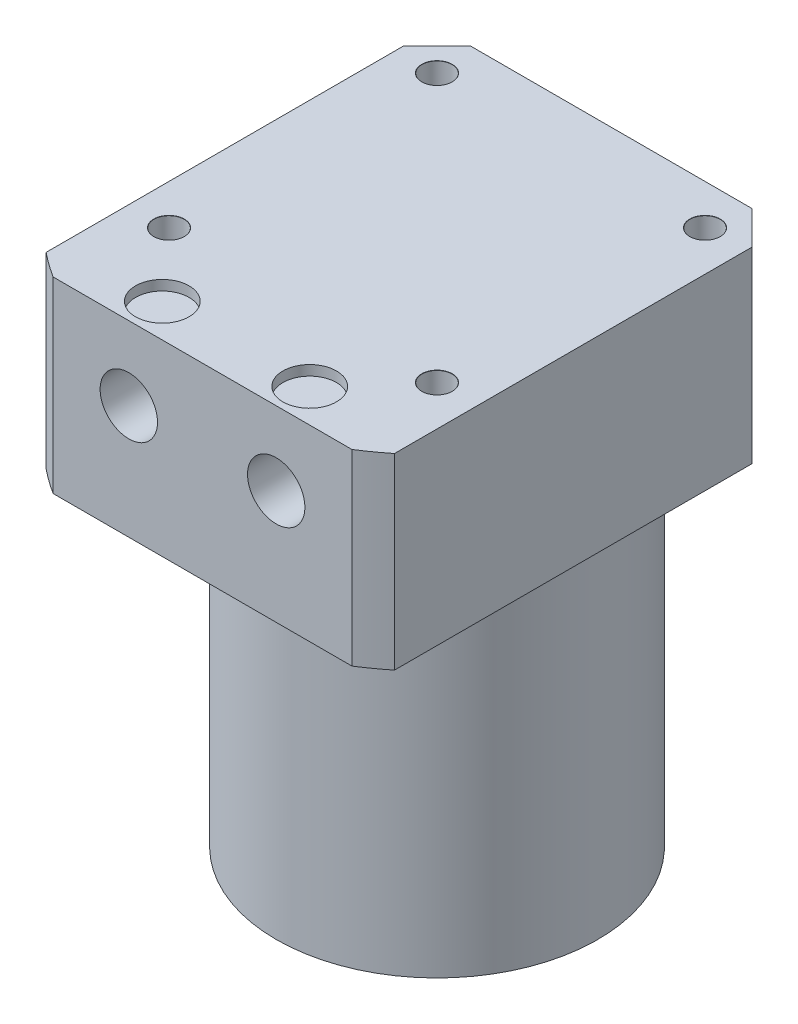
ISO-10303-21;
HEADER;
FILE_DESCRIPTION(('STEP AP214'),'2;1');
FILE_NAME('part.step','',(''),(''),'','','');
FILE_SCHEMA(('AUTOMOTIVE_DESIGN { 1 0 10303 214 1 1 1 1 }'));
ENDSEC;
DATA;
#1=APPLICATION_CONTEXT('core data for automotive mechanical design processes');
#2=APPLICATION_PROTOCOL_DEFINITION('international standard','automotive_design',2000,#1);
#3=PRODUCT_CONTEXT('',#1,'mechanical');
#4=PRODUCT('Part','Part','',(#3));
#5=PRODUCT_RELATED_PRODUCT_CATEGORY('part','',(#4));
#6=PRODUCT_DEFINITION_FORMATION('','',#4);
#7=PRODUCT_DEFINITION_CONTEXT('part definition',#1,'design');
#8=PRODUCT_DEFINITION('design','',#6,#7);
#9=PRODUCT_DEFINITION_SHAPE('','',#8);
#10=(LENGTH_UNIT() NAMED_UNIT(*) SI_UNIT(.MILLI.,.METRE.));
#11=(NAMED_UNIT(*) PLANE_ANGLE_UNIT() SI_UNIT($,.RADIAN.));
#12=(NAMED_UNIT(*) SI_UNIT($,.STERADIAN.) SOLID_ANGLE_UNIT());
#13=UNCERTAINTY_MEASURE_WITH_UNIT(LENGTH_MEASURE(1.E-05),#10,'distance_accuracy_value','');
#14=(GEOMETRIC_REPRESENTATION_CONTEXT(3) GLOBAL_UNCERTAINTY_ASSIGNED_CONTEXT((#13)) GLOBAL_UNIT_ASSIGNED_CONTEXT((#10,
#11,#12)) REPRESENTATION_CONTEXT('',''));
#15=CARTESIAN_POINT('',(0.,0.,0.));
#16=DIRECTION('',(0.,0.,1.));
#17=DIRECTION('',(1.,0.,0.));
#18=AXIS2_PLACEMENT_3D('',#15,#16,#17);
#19=CARTESIAN_POINT('',(-24.,52.,0.));
#20=DIRECTION('',(0.,-1.,0.));
#21=DIRECTION('',(0.,0.,-1.));
#22=AXIS2_PLACEMENT_3D('',#19,#20,#21);
#23=PLANE('',#22);
#24=CARTESIAN_POINT('',(-20.,52.,-20.));
#25=DIRECTION('',(0.,-1.,0.));
#26=DIRECTION('',(0.,0.,-1.));
#27=AXIS2_PLACEMENT_3D('',#24,#25,#26);
#28=CIRCLE('',#27,4.);
#29=CARTESIAN_POINT('',(-20.,52.,-24.));
#30=VERTEX_POINT('',#29);
#31=EDGE_CURVE('E337',#30,#30,#28,.T.);
#32=ORIENTED_EDGE('',*,*,#31,.F.);
#33=EDGE_LOOP('',(#32));
#34=FACE_BOUND('',#33,.T.);
#35=CARTESIAN_POINT('',(20.,52.,-20.));
#36=DIRECTION('',(0.,-1.,0.));
#37=DIRECTION('',(0.,0.,-1.));
#38=AXIS2_PLACEMENT_3D('',#35,#36,#37);
#39=CIRCLE('',#38,4.);
#40=CARTESIAN_POINT('',(20.,52.,-24.));
#41=VERTEX_POINT('',#40);
#42=EDGE_CURVE('E352',#41,#41,#39,.T.);
#43=ORIENTED_EDGE('',*,*,#42,.F.);
#44=EDGE_LOOP('',(#43));
#45=FACE_BOUND('',#44,.T.);
#46=CARTESIAN_POINT('',(20.,52.,20.));
#47=DIRECTION('',(0.,-1.,0.));
#48=DIRECTION('',(0.,0.,-1.));
#49=AXIS2_PLACEMENT_3D('',#46,#47,#48);
#50=CIRCLE('',#49,4.);
#51=CARTESIAN_POINT('',(20.,52.,16.));
#52=VERTEX_POINT('',#51);
#53=EDGE_CURVE('E367',#52,#52,#50,.T.);
#54=ORIENTED_EDGE('',*,*,#53,.F.);
#55=EDGE_LOOP('',(#54));
#56=FACE_BOUND('',#55,.T.);
#57=CARTESIAN_POINT('',(-20.,52.,20.));
#58=DIRECTION('',(0.,-1.,0.));
#59=DIRECTION('',(0.,0.,-1.));
#60=AXIS2_PLACEMENT_3D('',#57,#58,#59);
#61=CIRCLE('',#60,4.);
#62=CARTESIAN_POINT('',(-20.,52.,16.));
#63=VERTEX_POINT('',#62);
#64=EDGE_CURVE('E382',#63,#63,#61,.T.);
#65=ORIENTED_EDGE('',*,*,#64,.F.);
#66=EDGE_LOOP('',(#65));
#67=FACE_BOUND('',#66,.T.);
#68=CARTESIAN_POINT('',(0.,52.,0.));
#69=DIRECTION('',(0.,1.,0.));
#70=DIRECTION('',(0.,0.,1.));
#71=AXIS2_PLACEMENT_3D('',#68,#69,#70);
#72=CIRCLE('',#71,24.);
#73=CARTESIAN_POINT('',(0.,52.,24.));
#74=VERTEX_POINT('',#73);
#75=EDGE_CURVE('E134',#74,#74,#72,.T.);
#76=ORIENTED_EDGE('',*,*,#75,.T.);
#77=EDGE_LOOP('',(#76));
#78=FACE_BOUND('',#77,.T.);
#79=DIRECTION('',(1.,0.,0.));
#80=VECTOR('',#79,1.);
#81=CARTESIAN_POINT('',(-24.,52.,-26.));
#82=LINE('',#81,#80);
#83=CARTESIAN_POINT('',(-21.,52.,-26.));
#84=VERTEX_POINT('',#83);
#85=CARTESIAN_POINT('',(21.,52.,-26.));
#86=VERTEX_POINT('',#85);
#87=EDGE_CURVE('E108',#84,#86,#82,.T.);
#88=ORIENTED_EDGE('',*,*,#87,.T.);
#89=DIRECTION('',(-0.707106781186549,0.,-0.707106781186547));
#90=VECTOR('',#89,1.);
#91=CARTESIAN_POINT('',(11.4999999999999,52.,-35.5));
#92=LINE('',#91,#90);
#93=CARTESIAN_POINT('',(26.,52.,-21.));
#94=VERTEX_POINT('',#93);
#95=EDGE_CURVE('E42',#86,#94,#92,.F.);
#96=ORIENTED_EDGE('',*,*,#95,.T.);
#97=DIRECTION('',(0.,0.,1.));
#98=VECTOR('',#97,1.);
#99=CARTESIAN_POINT('',(26.,52.,0.));
#100=LINE('',#99,#98);
#101=CARTESIAN_POINT('',(26.,52.,32.3457879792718));
#102=VERTEX_POINT('',#101);
#103=EDGE_CURVE('E123',#94,#102,#100,.T.);
#104=ORIENTED_EDGE('',*,*,#103,.T.);
#105=CARTESIAN_POINT('',(0.,52.,0.));
#106=DIRECTION('',(0.,1.,0.));
#107=DIRECTION('',(0.,0.,1.));
#108=AXIS2_PLACEMENT_3D('',#105,#106,#107);
#109=CIRCLE('',#108,41.5);
#110=CARTESIAN_POINT('',(22.2991031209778,52.,35.));
#111=VERTEX_POINT('',#110);
#112=EDGE_CURVE('E131',#111,#102,#109,.T.);
#113=ORIENTED_EDGE('',*,*,#112,.F.);
#114=DIRECTION('',(-1.,0.,0.));
#115=VECTOR('',#114,1.);
#116=CARTESIAN_POINT('',(-24.,52.,35.));
#117=LINE('',#116,#115);
#118=CARTESIAN_POINT('',(-22.2991031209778,52.,35.));
#119=VERTEX_POINT('',#118);
#120=EDGE_CURVE('E178',#111,#119,#117,.T.);
#121=ORIENTED_EDGE('',*,*,#120,.T.);
#122=CARTESIAN_POINT('',(-26.,52.,32.3457879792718));
#123=VERTEX_POINT('',#122);
#124=EDGE_CURVE('E126',#123,#119,#109,.T.);
#125=ORIENTED_EDGE('',*,*,#124,.F.);
#126=DIRECTION('',(0.,0.,-1.));
#127=VECTOR('',#126,1.);
#128=CARTESIAN_POINT('',(-26.,52.,0.));
#129=LINE('',#128,#127);
#130=CARTESIAN_POINT('',(-26.,52.,-21.));
#131=VERTEX_POINT('',#130);
#132=EDGE_CURVE('E114',#123,#131,#129,.T.);
#133=ORIENTED_EDGE('',*,*,#132,.T.);
#134=DIRECTION('',(-0.707106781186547,0.,0.707106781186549));
#135=VECTOR('',#134,1.);
#136=CARTESIAN_POINT('',(-35.5,52.,-11.5));
#137=LINE('',#136,#135);
#138=EDGE_CURVE('E154',#131,#84,#137,.F.);
#139=ORIENTED_EDGE('',*,*,#138,.T.);
#140=EDGE_LOOP('',(#88,#96,#104,#113,#121,#125,#133,#139));
#141=FACE_BOUND('',#140,.T.);
#142=ADVANCED_FACE('F34',(#34,#45,#56,#67,#78,#141),#23,.T.);
#143=CARTESIAN_POINT('',(0.,87.0508296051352,0.));
#144=DIRECTION('',(0.,1.,0.));
#145=DIRECTION('',(0.,0.,1.));
#146=AXIS2_PLACEMENT_3D('',#143,#144,#145);
#147=CYLINDRICAL_SURFACE('',#146,41.5);
#148=ORIENTED_EDGE('',*,*,#112,.T.);
#149=DIRECTION('',(0.,1.,0.));
#150=VECTOR('',#149,1.);
#151=CARTESIAN_POINT('',(26.,87.0508296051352,32.3457879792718));
#152=LINE('',#151,#150);
#153=CARTESIAN_POINT('',(26.,80.,32.3457879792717));
#154=VERTEX_POINT('',#153);
#155=EDGE_CURVE('E127',#102,#154,#152,.T.);
#156=ORIENTED_EDGE('',*,*,#155,.T.);
#157=CARTESIAN_POINT('',(0.,80.,0.));
#158=DIRECTION('',(0.,1.,0.));
#159=DIRECTION('',(0.,0.,1.));
#160=AXIS2_PLACEMENT_3D('',#157,#158,#159);
#161=CIRCLE('',#160,41.5);
#162=CARTESIAN_POINT('',(22.2991031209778,80.,35.));
#163=VERTEX_POINT('',#162);
#164=EDGE_CURVE('E122',#163,#154,#161,.T.);
#165=ORIENTED_EDGE('',*,*,#164,.F.);
#166=DIRECTION('',(0.,1.,0.));
#167=VECTOR('',#166,1.);
#168=CARTESIAN_POINT('',(22.2991031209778,87.0508296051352,35.));
#169=LINE('',#168,#167);
#170=EDGE_CURVE('E181',#163,#111,#169,.F.);
#171=ORIENTED_EDGE('',*,*,#170,.T.);
#172=EDGE_LOOP('',(#148,#156,#165,#171));
#173=FACE_BOUND('',#172,.T.);
#174=ADVANCED_FACE('F185',(#173),#147,.T.);
#175=ORIENTED_EDGE('',*,*,#124,.T.);
#176=DIRECTION('',(0.,1.,0.));
#177=VECTOR('',#176,1.);
#178=CARTESIAN_POINT('',(-22.2991031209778,87.0508296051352,35.));
#179=LINE('',#178,#177);
#180=CARTESIAN_POINT('',(-22.2991031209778,80.,35.));
#181=VERTEX_POINT('',#180);
#182=EDGE_CURVE('E121',#119,#181,#179,.T.);
#183=ORIENTED_EDGE('',*,*,#182,.T.);
#184=CARTESIAN_POINT('',(-26.,80.,32.3457879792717));
#185=VERTEX_POINT('',#184);
#186=EDGE_CURVE('E105',#185,#181,#161,.T.);
#187=ORIENTED_EDGE('',*,*,#186,.F.);
#188=DIRECTION('',(0.,1.,0.));
#189=VECTOR('',#188,1.);
#190=CARTESIAN_POINT('',(-26.,87.0508296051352,32.3457879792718));
#191=LINE('',#190,#189);
#192=EDGE_CURVE('E112',#185,#123,#191,.F.);
#193=ORIENTED_EDGE('',*,*,#192,.T.);
#194=EDGE_LOOP('',(#175,#183,#187,#193));
#195=FACE_BOUND('',#194,.T.);
#196=ADVANCED_FACE('F120',(#195),#147,.T.);
#197=CARTESIAN_POINT('',(-41.5,80.,0.));
#198=DIRECTION('',(0.,1.,0.));
#199=DIRECTION('',(0.,0.,1.));
#200=AXIS2_PLACEMENT_3D('',#197,#198,#199);
#201=PLANE('',#200);
#202=CARTESIAN_POINT('',(-20.,80.,-20.));
#203=DIRECTION('',(0.,-1.,0.));
#204=DIRECTION('',(0.,0.,-1.));
#205=AXIS2_PLACEMENT_3D('',#202,#203,#204);
#206=CIRCLE('',#205,2.27499999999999);
#207=CARTESIAN_POINT('',(-20.,80.,-22.275));
#208=VERTEX_POINT('',#207);
#209=EDGE_CURVE('E338',#208,#208,#206,.T.);
#210=ORIENTED_EDGE('',*,*,#209,.T.);
#211=EDGE_LOOP('',(#210));
#212=FACE_BOUND('',#211,.T.);
#213=CARTESIAN_POINT('',(20.,80.,-20.));
#214=DIRECTION('',(0.,-1.,0.));
#215=DIRECTION('',(0.,0.,-1.));
#216=AXIS2_PLACEMENT_3D('',#213,#214,#215);
#217=CIRCLE('',#216,2.27499999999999);
#218=CARTESIAN_POINT('',(20.,80.,-22.275));
#219=VERTEX_POINT('',#218);
#220=EDGE_CURVE('E349',#219,#219,#217,.T.);
#221=ORIENTED_EDGE('',*,*,#220,.T.);
#222=EDGE_LOOP('',(#221));
#223=FACE_BOUND('',#222,.T.);
#224=CARTESIAN_POINT('',(20.,80.,20.));
#225=DIRECTION('',(0.,-1.,0.));
#226=DIRECTION('',(0.,0.,-1.));
#227=AXIS2_PLACEMENT_3D('',#224,#225,#226);
#228=CIRCLE('',#227,2.27499999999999);
#229=CARTESIAN_POINT('',(20.,80.,17.725));
#230=VERTEX_POINT('',#229);
#231=EDGE_CURVE('E364',#230,#230,#228,.T.);
#232=ORIENTED_EDGE('',*,*,#231,.T.);
#233=EDGE_LOOP('',(#232));
#234=FACE_BOUND('',#233,.T.);
#235=CARTESIAN_POINT('',(-20.,80.,20.));
#236=DIRECTION('',(0.,-1.,0.));
#237=DIRECTION('',(0.,0.,-1.));
#238=AXIS2_PLACEMENT_3D('',#235,#236,#237);
#239=CIRCLE('',#238,2.27499999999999);
#240=CARTESIAN_POINT('',(-20.,80.,17.725));
#241=VERTEX_POINT('',#240);
#242=EDGE_CURVE('E379',#241,#241,#239,.T.);
#243=ORIENTED_EDGE('',*,*,#242,.T.);
#244=EDGE_LOOP('',(#243));
#245=FACE_BOUND('',#244,.T.);
#246=CARTESIAN_POINT('',(-11.,80.,30.));
#247=DIRECTION('',(0.,1.,0.));
#248=DIRECTION('',(0.,0.,1.));
#249=AXIS2_PLACEMENT_3D('',#246,#247,#248);
#250=CIRCLE('',#249,4.);
#251=CARTESIAN_POINT('',(-11.,80.,34.));
#252=VERTEX_POINT('',#251);
#253=EDGE_CURVE('E406',#252,#252,#250,.T.);
#254=ORIENTED_EDGE('',*,*,#253,.F.);
#255=EDGE_LOOP('',(#254));
#256=FACE_BOUND('',#255,.T.);
#257=CARTESIAN_POINT('',(11.,80.,30.));
#258=DIRECTION('',(0.,1.,0.));
#259=DIRECTION('',(0.,0.,1.));
#260=AXIS2_PLACEMENT_3D('',#257,#258,#259);
#261=CIRCLE('',#260,4.);
#262=CARTESIAN_POINT('',(11.,80.,34.));
#263=VERTEX_POINT('',#262);
#264=EDGE_CURVE('E171',#263,#263,#261,.T.);
#265=ORIENTED_EDGE('',*,*,#264,.F.);
#266=EDGE_LOOP('',(#265));
#267=FACE_BOUND('',#266,.T.);
#268=DIRECTION('',(0.,0.,-1.));
#269=VECTOR('',#268,1.);
#270=CARTESIAN_POINT('',(26.,80.,0.));
#271=LINE('',#270,#269);
#272=CARTESIAN_POINT('',(26.,80.,-21.));
#273=VERTEX_POINT('',#272);
#274=EDGE_CURVE('E140',#154,#273,#271,.T.);
#275=ORIENTED_EDGE('',*,*,#274,.T.);
#276=DIRECTION('',(0.707106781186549,0.,0.707106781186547));
#277=VECTOR('',#276,1.);
#278=CARTESIAN_POINT('',(2.74999999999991,80.,-44.25));
#279=LINE('',#278,#277);
#280=CARTESIAN_POINT('',(21.,80.,-26.));
#281=VERTEX_POINT('',#280);
#282=EDGE_CURVE('E148',#273,#281,#279,.F.);
#283=ORIENTED_EDGE('',*,*,#282,.T.);
#284=DIRECTION('',(-1.,0.,0.));
#285=VECTOR('',#284,1.);
#286=CARTESIAN_POINT('',(-26.,80.,-26.));
#287=LINE('',#286,#285);
#288=CARTESIAN_POINT('',(-21.,80.,-26.));
#289=VERTEX_POINT('',#288);
#290=EDGE_CURVE('E109',#281,#289,#287,.T.);
#291=ORIENTED_EDGE('',*,*,#290,.T.);
#292=DIRECTION('',(0.707106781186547,0.,-0.707106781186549));
#293=VECTOR('',#292,1.);
#294=CARTESIAN_POINT('',(-44.25,80.,-2.74999999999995));
#295=LINE('',#294,#293);
#296=CARTESIAN_POINT('',(-26.,80.,-21.));
#297=VERTEX_POINT('',#296);
#298=EDGE_CURVE('E107',#289,#297,#295,.F.);
#299=ORIENTED_EDGE('',*,*,#298,.T.);
#300=DIRECTION('',(0.,0.,1.));
#301=VECTOR('',#300,1.);
#302=CARTESIAN_POINT('',(-26.,80.,-26.));
#303=LINE('',#302,#301);
#304=EDGE_CURVE('E99',#297,#185,#303,.T.);
#305=ORIENTED_EDGE('',*,*,#304,.T.);
#306=ORIENTED_EDGE('',*,*,#186,.T.);
#307=DIRECTION('',(1.,0.,0.));
#308=VECTOR('',#307,1.);
#309=CARTESIAN_POINT('',(-41.5,80.,35.));
#310=LINE('',#309,#308);
#311=EDGE_CURVE('E142',#181,#163,#310,.T.);
#312=ORIENTED_EDGE('',*,*,#311,.T.);
#313=ORIENTED_EDGE('',*,*,#164,.T.);
#314=EDGE_LOOP('',(#275,#283,#291,#299,#305,#306,#312,#313));
#315=FACE_BOUND('',#314,.T.);
#316=ADVANCED_FACE('F102',(#212,#223,#234,#245,#256,#267,#315),#201,.T.);
#317=CARTESIAN_POINT('',(0.,0.,0.));
#318=DIRECTION('',(0.,-1.,0.));
#319=DIRECTION('',(0.,0.,-1.));
#320=AXIS2_PLACEMENT_3D('',#317,#318,#319);
#321=PLANE('',#320);
#322=CARTESIAN_POINT('',(0.,0.,0.));
#323=DIRECTION('',(0.,1.,0.));
#324=DIRECTION('',(0.,0.,1.));
#325=AXIS2_PLACEMENT_3D('',#322,#323,#324);
#326=CIRCLE('',#325,24.);
#327=CARTESIAN_POINT('',(0.,0.,24.));
#328=VERTEX_POINT('',#327);
#329=EDGE_CURVE('E137',#328,#328,#326,.T.);
#330=ORIENTED_EDGE('',*,*,#329,.F.);
#331=EDGE_LOOP('',(#330));
#332=FACE_BOUND('',#331,.T.);
#333=ADVANCED_FACE('F213',(#332),#321,.T.);
#334=CARTESIAN_POINT('',(0.,87.0508296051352,0.));
#335=DIRECTION('',(0.,1.,0.));
#336=DIRECTION('',(0.,0.,1.));
#337=AXIS2_PLACEMENT_3D('',#334,#335,#336);
#338=CYLINDRICAL_SURFACE('',#337,24.);
#339=ORIENTED_EDGE('',*,*,#329,.T.);
#340=EDGE_LOOP('',(#339));
#341=FACE_BOUND('',#340,.T.);
#342=ORIENTED_EDGE('',*,*,#75,.F.);
#343=EDGE_LOOP('',(#342));
#344=FACE_BOUND('',#343,.T.);
#345=ADVANCED_FACE('F210',(#341,#344),#338,.T.);
#346=CARTESIAN_POINT('',(-26.,0.,-26.));
#347=DIRECTION('',(0.,0.,-1.));
#348=DIRECTION('',(-1.,0.,0.));
#349=AXIS2_PLACEMENT_3D('',#346,#347,#348);
#350=PLANE('',#349);
#351=ORIENTED_EDGE('',*,*,#290,.F.);
#352=DIRECTION('',(0.,-1.,0.));
#353=VECTOR('',#352,1.);
#354=CARTESIAN_POINT('',(21.,0.,-26.));
#355=LINE('',#354,#353);
#356=EDGE_CURVE('E55',#281,#86,#355,.T.);
#357=ORIENTED_EDGE('',*,*,#356,.T.);
#358=ORIENTED_EDGE('',*,*,#87,.F.);
#359=DIRECTION('',(0.,1.,0.));
#360=VECTOR('',#359,1.);
#361=CARTESIAN_POINT('',(-21.,0.,-26.));
#362=LINE('',#361,#360);
#363=EDGE_CURVE('E150',#84,#289,#362,.T.);
#364=ORIENTED_EDGE('',*,*,#363,.T.);
#365=EDGE_LOOP('',(#351,#357,#358,#364));
#366=FACE_BOUND('',#365,.T.);
#367=ADVANCED_FACE('F166',(#366),#350,.T.);
#368=CARTESIAN_POINT('',(-26.,0.,-26.));
#369=DIRECTION('',(-1.,0.,0.));
#370=DIRECTION('',(0.,0.,1.));
#371=AXIS2_PLACEMENT_3D('',#368,#369,#370);
#372=PLANE('',#371);
#373=ORIENTED_EDGE('',*,*,#304,.F.);
#374=DIRECTION('',(0.,-1.,0.));
#375=VECTOR('',#374,1.);
#376=CARTESIAN_POINT('',(-26.,0.,-21.));
#377=LINE('',#376,#375);
#378=EDGE_CURVE('E12',#297,#131,#377,.T.);
#379=ORIENTED_EDGE('',*,*,#378,.T.);
#380=ORIENTED_EDGE('',*,*,#132,.F.);
#381=ORIENTED_EDGE('',*,*,#192,.F.);
#382=EDGE_LOOP('',(#373,#379,#380,#381));
#383=FACE_BOUND('',#382,.T.);
#384=ADVANCED_FACE('F113',(#383),#372,.T.);
#385=CARTESIAN_POINT('',(26.,0.,-26.));
#386=DIRECTION('',(1.,0.,0.));
#387=DIRECTION('',(0.,0.,-1.));
#388=AXIS2_PLACEMENT_3D('',#385,#386,#387);
#389=PLANE('',#388);
#390=ORIENTED_EDGE('',*,*,#103,.F.);
#391=DIRECTION('',(0.,1.,0.));
#392=VECTOR('',#391,1.);
#393=CARTESIAN_POINT('',(26.,0.,-21.));
#394=LINE('',#393,#392);
#395=EDGE_CURVE('E144',#94,#273,#394,.T.);
#396=ORIENTED_EDGE('',*,*,#395,.T.);
#397=ORIENTED_EDGE('',*,*,#274,.F.);
#398=ORIENTED_EDGE('',*,*,#155,.F.);
#399=EDGE_LOOP('',(#390,#396,#397,#398));
#400=FACE_BOUND('',#399,.T.);
#401=ADVANCED_FACE('F163',(#400),#389,.T.);
#402=CARTESIAN_POINT('',(-26.,0.,35.));
#403=DIRECTION('',(0.,0.,1.));
#404=DIRECTION('',(1.,0.,0.));
#405=AXIS2_PLACEMENT_3D('',#402,#403,#404);
#406=PLANE('',#405);
#407=CARTESIAN_POINT('',(-11.,69.,35.));
#408=DIRECTION('',(0.,0.,1.));
#409=DIRECTION('',(1.,0.,0.));
#410=AXIS2_PLACEMENT_3D('',#407,#408,#409);
#411=CIRCLE('',#410,4.283);
#412=CARTESIAN_POINT('',(-6.717,69.,35.));
#413=VERTEX_POINT('',#412);
#414=EDGE_CURVE('E394',#413,#413,#411,.T.);
#415=ORIENTED_EDGE('',*,*,#414,.F.);
#416=EDGE_LOOP('',(#415));
#417=FACE_BOUND('',#416,.T.);
#418=CARTESIAN_POINT('',(11.,69.,35.));
#419=DIRECTION('',(0.,0.,1.));
#420=DIRECTION('',(1.,0.,0.));
#421=AXIS2_PLACEMENT_3D('',#418,#419,#420);
#422=CIRCLE('',#421,4.283);
#423=CARTESIAN_POINT('',(15.283,69.,35.));
#424=VERTEX_POINT('',#423);
#425=EDGE_CURVE('E400',#424,#424,#422,.T.);
#426=ORIENTED_EDGE('',*,*,#425,.F.);
#427=EDGE_LOOP('',(#426));
#428=FACE_BOUND('',#427,.T.);
#429=ORIENTED_EDGE('',*,*,#311,.F.);
#430=ORIENTED_EDGE('',*,*,#182,.F.);
#431=ORIENTED_EDGE('',*,*,#120,.F.);
#432=ORIENTED_EDGE('',*,*,#170,.F.);
#433=EDGE_LOOP('',(#429,#430,#431,#432));
#434=FACE_BOUND('',#433,.T.);
#435=ADVANCED_FACE('F187',(#417,#428,#434),#406,.T.);
#436=CARTESIAN_POINT('',(26.,0.,-21.));
#437=DIRECTION('',(-0.707106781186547,0.,0.707106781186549));
#438=DIRECTION('',(0.707106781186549,0.,0.707106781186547));
#439=AXIS2_PLACEMENT_3D('',#436,#437,#438);
#440=PLANE('',#439);
#441=ORIENTED_EDGE('',*,*,#95,.F.);
#442=ORIENTED_EDGE('',*,*,#356,.F.);
#443=ORIENTED_EDGE('',*,*,#282,.F.);
#444=ORIENTED_EDGE('',*,*,#395,.F.);
#445=EDGE_LOOP('',(#441,#442,#443,#444));
#446=FACE_BOUND('',#445,.T.);
#447=ADVANCED_FACE('F165',(#446),#440,.F.);
#448=CARTESIAN_POINT('',(-21.,0.,-26.));
#449=DIRECTION('',(0.707106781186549,0.,0.707106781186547));
#450=DIRECTION('',(0.707106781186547,0.,-0.707106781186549));
#451=AXIS2_PLACEMENT_3D('',#448,#449,#450);
#452=PLANE('',#451);
#453=ORIENTED_EDGE('',*,*,#138,.F.);
#454=ORIENTED_EDGE('',*,*,#378,.F.);
#455=ORIENTED_EDGE('',*,*,#298,.F.);
#456=ORIENTED_EDGE('',*,*,#363,.F.);
#457=EDGE_LOOP('',(#453,#454,#455,#456));
#458=FACE_BOUND('',#457,.T.);
#459=ADVANCED_FACE('F36',(#458),#452,.F.);
#460=CARTESIAN_POINT('',(11.,78.5,30.));
#461=DIRECTION('',(0.,-1.,0.));
#462=DIRECTION('',(0.,0.,-1.));
#463=AXIS2_PLACEMENT_3D('',#460,#461,#462);
#464=PLANE('',#463);
#465=CARTESIAN_POINT('',(11.,78.5,30.));
#466=DIRECTION('',(0.,1.,0.));
#467=DIRECTION('',(0.,0.,1.));
#468=AXIS2_PLACEMENT_3D('',#465,#466,#467);
#469=CIRCLE('',#468,4.);
#470=CARTESIAN_POINT('',(11.,78.5,34.));
#471=VERTEX_POINT('',#470);
#472=EDGE_CURVE('E168',#471,#471,#469,.T.);
#473=ORIENTED_EDGE('',*,*,#472,.T.);
#474=EDGE_LOOP('',(#473));
#475=FACE_BOUND('',#474,.T.);
#476=ADVANCED_FACE('F191',(#475),#464,.F.);
#477=CARTESIAN_POINT('',(11.,80.,30.));
#478=DIRECTION('',(0.,1.,0.));
#479=DIRECTION('',(0.,0.,1.));
#480=AXIS2_PLACEMENT_3D('',#477,#478,#479);
#481=CYLINDRICAL_SURFACE('',#480,4.);
#482=ORIENTED_EDGE('',*,*,#472,.F.);
#483=EDGE_LOOP('',(#482));
#484=FACE_BOUND('',#483,.T.);
#485=ORIENTED_EDGE('',*,*,#264,.T.);
#486=EDGE_LOOP('',(#485));
#487=FACE_BOUND('',#486,.T.);
#488=ADVANCED_FACE('F196',(#484,#487),#481,.F.);
#489=CARTESIAN_POINT('',(-11.,78.5,30.));
#490=DIRECTION('',(0.,-1.,0.));
#491=DIRECTION('',(0.,0.,-1.));
#492=AXIS2_PLACEMENT_3D('',#489,#490,#491);
#493=PLANE('',#492);
#494=CARTESIAN_POINT('',(-11.,78.5,30.));
#495=DIRECTION('',(0.,1.,0.));
#496=DIRECTION('',(0.,0.,1.));
#497=AXIS2_PLACEMENT_3D('',#494,#495,#496);
#498=CIRCLE('',#497,4.);
#499=CARTESIAN_POINT('',(-11.,78.5,34.));
#500=VERTEX_POINT('',#499);
#501=EDGE_CURVE('E409',#500,#500,#498,.T.);
#502=ORIENTED_EDGE('',*,*,#501,.T.);
#503=EDGE_LOOP('',(#502));
#504=FACE_BOUND('',#503,.T.);
#505=ADVANCED_FACE('F242',(#504),#493,.F.);
#506=CARTESIAN_POINT('',(-11.,80.,30.));
#507=DIRECTION('',(0.,1.,0.));
#508=DIRECTION('',(0.,0.,1.));
#509=AXIS2_PLACEMENT_3D('',#506,#507,#508);
#510=CYLINDRICAL_SURFACE('',#509,4.);
#511=ORIENTED_EDGE('',*,*,#501,.F.);
#512=EDGE_LOOP('',(#511));
#513=FACE_BOUND('',#512,.T.);
#514=ORIENTED_EDGE('',*,*,#253,.T.);
#515=EDGE_LOOP('',(#514));
#516=FACE_BOUND('',#515,.T.);
#517=ADVANCED_FACE('F246',(#513,#516),#510,.F.);
#518=CARTESIAN_POINT('',(11.,69.,12.82));
#519=DIRECTION('',(0.,0.,-1.));
#520=DIRECTION('',(-1.,0.,0.));
#521=AXIS2_PLACEMENT_3D('',#518,#519,#520);
#522=PLANE('',#521);
#523=CARTESIAN_POINT('',(11.,69.,12.82));
#524=DIRECTION('',(0.,0.,1.));
#525=DIRECTION('',(1.,0.,0.));
#526=AXIS2_PLACEMENT_3D('',#523,#524,#525);
#527=CIRCLE('',#526,4.283);
#528=CARTESIAN_POINT('',(15.283,69.,12.82));
#529=VERTEX_POINT('',#528);
#530=EDGE_CURVE('E403',#529,#529,#527,.T.);
#531=ORIENTED_EDGE('',*,*,#530,.T.);
#532=EDGE_LOOP('',(#531));
#533=FACE_BOUND('',#532,.T.);
#534=ADVANCED_FACE('F250',(#533),#522,.F.);
#535=CARTESIAN_POINT('',(11.,69.,35.));
#536=DIRECTION('',(0.,0.,1.));
#537=DIRECTION('',(1.,0.,0.));
#538=AXIS2_PLACEMENT_3D('',#535,#536,#537);
#539=CYLINDRICAL_SURFACE('',#538,4.283);
#540=ORIENTED_EDGE('',*,*,#530,.F.);
#541=EDGE_LOOP('',(#540));
#542=FACE_BOUND('',#541,.T.);
#543=ORIENTED_EDGE('',*,*,#425,.T.);
#544=EDGE_LOOP('',(#543));
#545=FACE_BOUND('',#544,.T.);
#546=ADVANCED_FACE('F254',(#542,#545),#539,.F.);
#547=CARTESIAN_POINT('',(-11.,69.,12.82));
#548=DIRECTION('',(0.,0.,-1.));
#549=DIRECTION('',(-1.,0.,0.));
#550=AXIS2_PLACEMENT_3D('',#547,#548,#549);
#551=PLANE('',#550);
#552=CARTESIAN_POINT('',(-11.,69.,12.82));
#553=DIRECTION('',(0.,0.,1.));
#554=DIRECTION('',(1.,0.,0.));
#555=AXIS2_PLACEMENT_3D('',#552,#553,#554);
#556=CIRCLE('',#555,4.283);
#557=CARTESIAN_POINT('',(-6.717,69.,12.82));
#558=VERTEX_POINT('',#557);
#559=EDGE_CURVE('E397',#558,#558,#556,.T.);
#560=ORIENTED_EDGE('',*,*,#559,.T.);
#561=EDGE_LOOP('',(#560));
#562=FACE_BOUND('',#561,.T.);
#563=ADVANCED_FACE('F258',(#562),#551,.F.);
#564=CARTESIAN_POINT('',(-11.,69.,35.));
#565=DIRECTION('',(0.,0.,1.));
#566=DIRECTION('',(1.,0.,0.));
#567=AXIS2_PLACEMENT_3D('',#564,#565,#566);
#568=CYLINDRICAL_SURFACE('',#567,4.283);
#569=ORIENTED_EDGE('',*,*,#559,.F.);
#570=EDGE_LOOP('',(#569));
#571=FACE_BOUND('',#570,.T.);
#572=ORIENTED_EDGE('',*,*,#414,.T.);
#573=EDGE_LOOP('',(#572));
#574=FACE_BOUND('',#573,.T.);
#575=ADVANCED_FACE('F262',(#571,#574),#568,.F.);
#576=CARTESIAN_POINT('',(-20.,79.975,20.));
#577=DIRECTION('',(0.,1.,0.));
#578=DIRECTION('',(0.,0.,1.));
#579=AXIS2_PLACEMENT_3D('',#576,#577,#578);
#580=CONICAL_SURFACE('',#579,2.25,0.785398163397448);
#581=ORIENTED_EDGE('',*,*,#242,.F.);
#582=EDGE_LOOP('',(#581));
#583=FACE_BOUND('',#582,.T.);
#584=CARTESIAN_POINT('',(-20.,79.975,20.));
#585=DIRECTION('',(0.,-1.,0.));
#586=DIRECTION('',(0.,0.,-1.));
#587=AXIS2_PLACEMENT_3D('',#584,#585,#586);
#588=CIRCLE('',#587,2.25);
#589=CARTESIAN_POINT('',(-20.,79.975,17.75));
#590=VERTEX_POINT('',#589);
#591=EDGE_CURVE('E391',#590,#590,#588,.T.);
#592=ORIENTED_EDGE('',*,*,#591,.T.);
#593=EDGE_LOOP('',(#592));
#594=FACE_BOUND('',#593,.T.);
#595=ADVANCED_FACE('F266',(#583,#594),#580,.F.);
#596=CARTESIAN_POINT('',(-20.,52.,20.));
#597=DIRECTION('',(0.,-1.,0.));
#598=DIRECTION('',(0.,0.,-1.));
#599=AXIS2_PLACEMENT_3D('',#596,#597,#598);
#600=CYLINDRICAL_SURFACE('',#599,2.25);
#601=ORIENTED_EDGE('',*,*,#591,.F.);
#602=EDGE_LOOP('',(#601));
#603=FACE_BOUND('',#602,.T.);
#604=CARTESIAN_POINT('',(-20.,56.,20.));
#605=DIRECTION('',(0.,-1.,0.));
#606=DIRECTION('',(0.,0.,-1.));
#607=AXIS2_PLACEMENT_3D('',#604,#605,#606);
#608=CIRCLE('',#607,2.25);
#609=CARTESIAN_POINT('',(-20.,56.,17.75));
#610=VERTEX_POINT('',#609);
#611=EDGE_CURVE('E388',#610,#610,#608,.T.);
#612=ORIENTED_EDGE('',*,*,#611,.T.);
#613=EDGE_LOOP('',(#612));
#614=FACE_BOUND('',#613,.T.);
#615=ADVANCED_FACE('F270',(#603,#614),#600,.F.);
#616=CARTESIAN_POINT('',(-17.75,56.,20.));
#617=DIRECTION('',(0.,1.,0.));
#618=DIRECTION('',(0.,0.,1.));
#619=AXIS2_PLACEMENT_3D('',#616,#617,#618);
#620=PLANE('',#619);
#621=ORIENTED_EDGE('',*,*,#611,.F.);
#622=EDGE_LOOP('',(#621));
#623=FACE_BOUND('',#622,.T.);
#624=CARTESIAN_POINT('',(-20.,56.,20.));
#625=DIRECTION('',(0.,-1.,0.));
#626=DIRECTION('',(0.,0.,-1.));
#627=AXIS2_PLACEMENT_3D('',#624,#625,#626);
#628=CIRCLE('',#627,4.);
#629=CARTESIAN_POINT('',(-20.,56.,16.));
#630=VERTEX_POINT('',#629);
#631=EDGE_CURVE('E385',#630,#630,#628,.T.);
#632=ORIENTED_EDGE('',*,*,#631,.T.);
#633=EDGE_LOOP('',(#632));
#634=FACE_BOUND('',#633,.T.);
#635=ADVANCED_FACE('F274',(#623,#634),#620,.F.);
#636=CARTESIAN_POINT('',(-20.,52.,20.));
#637=DIRECTION('',(0.,-1.,0.));
#638=DIRECTION('',(0.,0.,-1.));
#639=AXIS2_PLACEMENT_3D('',#636,#637,#638);
#640=CYLINDRICAL_SURFACE('',#639,4.);
#641=ORIENTED_EDGE('',*,*,#631,.F.);
#642=EDGE_LOOP('',(#641));
#643=FACE_BOUND('',#642,.T.);
#644=ORIENTED_EDGE('',*,*,#64,.T.);
#645=EDGE_LOOP('',(#644));
#646=FACE_BOUND('',#645,.T.);
#647=ADVANCED_FACE('F278',(#643,#646),#640,.F.);
#648=CARTESIAN_POINT('',(20.,79.975,20.));
#649=DIRECTION('',(0.,1.,0.));
#650=DIRECTION('',(0.,0.,1.));
#651=AXIS2_PLACEMENT_3D('',#648,#649,#650);
#652=CONICAL_SURFACE('',#651,2.25,0.785398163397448);
#653=ORIENTED_EDGE('',*,*,#231,.F.);
#654=EDGE_LOOP('',(#653));
#655=FACE_BOUND('',#654,.T.);
#656=CARTESIAN_POINT('',(20.,79.975,20.));
#657=DIRECTION('',(0.,-1.,0.));
#658=DIRECTION('',(0.,0.,-1.));
#659=AXIS2_PLACEMENT_3D('',#656,#657,#658);
#660=CIRCLE('',#659,2.25);
#661=CARTESIAN_POINT('',(20.,79.975,17.75));
#662=VERTEX_POINT('',#661);
#663=EDGE_CURVE('E376',#662,#662,#660,.T.);
#664=ORIENTED_EDGE('',*,*,#663,.T.);
#665=EDGE_LOOP('',(#664));
#666=FACE_BOUND('',#665,.T.);
#667=ADVANCED_FACE('F282',(#655,#666),#652,.F.);
#668=CARTESIAN_POINT('',(20.,52.,20.));
#669=DIRECTION('',(0.,-1.,0.));
#670=DIRECTION('',(0.,0.,-1.));
#671=AXIS2_PLACEMENT_3D('',#668,#669,#670);
#672=CYLINDRICAL_SURFACE('',#671,2.25);
#673=ORIENTED_EDGE('',*,*,#663,.F.);
#674=EDGE_LOOP('',(#673));
#675=FACE_BOUND('',#674,.T.);
#676=CARTESIAN_POINT('',(20.,56.,20.));
#677=DIRECTION('',(0.,-1.,0.));
#678=DIRECTION('',(0.,0.,-1.));
#679=AXIS2_PLACEMENT_3D('',#676,#677,#678);
#680=CIRCLE('',#679,2.25);
#681=CARTESIAN_POINT('',(20.,56.,17.75));
#682=VERTEX_POINT('',#681);
#683=EDGE_CURVE('E373',#682,#682,#680,.T.);
#684=ORIENTED_EDGE('',*,*,#683,.T.);
#685=EDGE_LOOP('',(#684));
#686=FACE_BOUND('',#685,.T.);
#687=ADVANCED_FACE('F286',(#675,#686),#672,.F.);
#688=CARTESIAN_POINT('',(22.25,56.,20.));
#689=DIRECTION('',(0.,1.,0.));
#690=DIRECTION('',(0.,0.,1.));
#691=AXIS2_PLACEMENT_3D('',#688,#689,#690);
#692=PLANE('',#691);
#693=ORIENTED_EDGE('',*,*,#683,.F.);
#694=EDGE_LOOP('',(#693));
#695=FACE_BOUND('',#694,.T.);
#696=CARTESIAN_POINT('',(20.,56.,20.));
#697=DIRECTION('',(0.,-1.,0.));
#698=DIRECTION('',(0.,0.,-1.));
#699=AXIS2_PLACEMENT_3D('',#696,#697,#698);
#700=CIRCLE('',#699,4.);
#701=CARTESIAN_POINT('',(20.,56.,16.));
#702=VERTEX_POINT('',#701);
#703=EDGE_CURVE('E370',#702,#702,#700,.T.);
#704=ORIENTED_EDGE('',*,*,#703,.T.);
#705=EDGE_LOOP('',(#704));
#706=FACE_BOUND('',#705,.T.);
#707=ADVANCED_FACE('F290',(#695,#706),#692,.F.);
#708=CARTESIAN_POINT('',(20.,52.,20.));
#709=DIRECTION('',(0.,-1.,0.));
#710=DIRECTION('',(0.,0.,-1.));
#711=AXIS2_PLACEMENT_3D('',#708,#709,#710);
#712=CYLINDRICAL_SURFACE('',#711,4.);
#713=ORIENTED_EDGE('',*,*,#703,.F.);
#714=EDGE_LOOP('',(#713));
#715=FACE_BOUND('',#714,.T.);
#716=ORIENTED_EDGE('',*,*,#53,.T.);
#717=EDGE_LOOP('',(#716));
#718=FACE_BOUND('',#717,.T.);
#719=ADVANCED_FACE('F294',(#715,#718),#712,.F.);
#720=CARTESIAN_POINT('',(20.,79.975,-20.));
#721=DIRECTION('',(0.,1.,0.));
#722=DIRECTION('',(0.,0.,1.));
#723=AXIS2_PLACEMENT_3D('',#720,#721,#722);
#724=CONICAL_SURFACE('',#723,2.25,0.785398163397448);
#725=ORIENTED_EDGE('',*,*,#220,.F.);
#726=EDGE_LOOP('',(#725));
#727=FACE_BOUND('',#726,.T.);
#728=CARTESIAN_POINT('',(20.,79.975,-20.));
#729=DIRECTION('',(0.,-1.,0.));
#730=DIRECTION('',(0.,0.,-1.));
#731=AXIS2_PLACEMENT_3D('',#728,#729,#730);
#732=CIRCLE('',#731,2.25);
#733=CARTESIAN_POINT('',(20.,79.975,-22.25));
#734=VERTEX_POINT('',#733);
#735=EDGE_CURVE('E361',#734,#734,#732,.T.);
#736=ORIENTED_EDGE('',*,*,#735,.T.);
#737=EDGE_LOOP('',(#736));
#738=FACE_BOUND('',#737,.T.);
#739=ADVANCED_FACE('F298',(#727,#738),#724,.F.);
#740=CARTESIAN_POINT('',(20.,52.,-20.));
#741=DIRECTION('',(0.,-1.,0.));
#742=DIRECTION('',(0.,0.,-1.));
#743=AXIS2_PLACEMENT_3D('',#740,#741,#742);
#744=CYLINDRICAL_SURFACE('',#743,2.25);
#745=ORIENTED_EDGE('',*,*,#735,.F.);
#746=EDGE_LOOP('',(#745));
#747=FACE_BOUND('',#746,.T.);
#748=CARTESIAN_POINT('',(20.,56.,-20.));
#749=DIRECTION('',(0.,-1.,0.));
#750=DIRECTION('',(0.,0.,-1.));
#751=AXIS2_PLACEMENT_3D('',#748,#749,#750);
#752=CIRCLE('',#751,2.25);
#753=CARTESIAN_POINT('',(20.,56.,-22.25));
#754=VERTEX_POINT('',#753);
#755=EDGE_CURVE('E358',#754,#754,#752,.T.);
#756=ORIENTED_EDGE('',*,*,#755,.T.);
#757=EDGE_LOOP('',(#756));
#758=FACE_BOUND('',#757,.T.);
#759=ADVANCED_FACE('F302',(#747,#758),#744,.F.);
#760=CARTESIAN_POINT('',(22.25,56.,-20.));
#761=DIRECTION('',(0.,1.,0.));
#762=DIRECTION('',(0.,0.,1.));
#763=AXIS2_PLACEMENT_3D('',#760,#761,#762);
#764=PLANE('',#763);
#765=ORIENTED_EDGE('',*,*,#755,.F.);
#766=EDGE_LOOP('',(#765));
#767=FACE_BOUND('',#766,.T.);
#768=CARTESIAN_POINT('',(20.,56.,-20.));
#769=DIRECTION('',(0.,-1.,0.));
#770=DIRECTION('',(0.,0.,-1.));
#771=AXIS2_PLACEMENT_3D('',#768,#769,#770);
#772=CIRCLE('',#771,4.);
#773=CARTESIAN_POINT('',(20.,56.,-24.));
#774=VERTEX_POINT('',#773);
#775=EDGE_CURVE('E355',#774,#774,#772,.T.);
#776=ORIENTED_EDGE('',*,*,#775,.T.);
#777=EDGE_LOOP('',(#776));
#778=FACE_BOUND('',#777,.T.);
#779=ADVANCED_FACE('F306',(#767,#778),#764,.F.);
#780=CARTESIAN_POINT('',(20.,52.,-20.));
#781=DIRECTION('',(0.,-1.,0.));
#782=DIRECTION('',(0.,0.,-1.));
#783=AXIS2_PLACEMENT_3D('',#780,#781,#782);
#784=CYLINDRICAL_SURFACE('',#783,4.);
#785=ORIENTED_EDGE('',*,*,#775,.F.);
#786=EDGE_LOOP('',(#785));
#787=FACE_BOUND('',#786,.T.);
#788=ORIENTED_EDGE('',*,*,#42,.T.);
#789=EDGE_LOOP('',(#788));
#790=FACE_BOUND('',#789,.T.);
#791=ADVANCED_FACE('F310',(#787,#790),#784,.F.);
#792=CARTESIAN_POINT('',(-20.,79.975,-20.));
#793=DIRECTION('',(0.,1.,0.));
#794=DIRECTION('',(0.,0.,1.));
#795=AXIS2_PLACEMENT_3D('',#792,#793,#794);
#796=CONICAL_SURFACE('',#795,2.25,0.785398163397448);
#797=ORIENTED_EDGE('',*,*,#209,.F.);
#798=EDGE_LOOP('',(#797));
#799=FACE_BOUND('',#798,.T.);
#800=CARTESIAN_POINT('',(-20.,79.975,-20.));
#801=DIRECTION('',(0.,-1.,0.));
#802=DIRECTION('',(0.,0.,-1.));
#803=AXIS2_PLACEMENT_3D('',#800,#801,#802);
#804=CIRCLE('',#803,2.25);
#805=CARTESIAN_POINT('',(-20.,79.975,-22.25));
#806=VERTEX_POINT('',#805);
#807=EDGE_CURVE('E346',#806,#806,#804,.T.);
#808=ORIENTED_EDGE('',*,*,#807,.T.);
#809=EDGE_LOOP('',(#808));
#810=FACE_BOUND('',#809,.T.);
#811=ADVANCED_FACE('F314',(#799,#810),#796,.F.);
#812=CARTESIAN_POINT('',(-20.,52.,-20.));
#813=DIRECTION('',(0.,-1.,0.));
#814=DIRECTION('',(0.,0.,-1.));
#815=AXIS2_PLACEMENT_3D('',#812,#813,#814);
#816=CYLINDRICAL_SURFACE('',#815,2.25);
#817=ORIENTED_EDGE('',*,*,#807,.F.);
#818=EDGE_LOOP('',(#817));
#819=FACE_BOUND('',#818,.T.);
#820=CARTESIAN_POINT('',(-20.,56.,-20.));
#821=DIRECTION('',(0.,-1.,0.));
#822=DIRECTION('',(0.,0.,-1.));
#823=AXIS2_PLACEMENT_3D('',#820,#821,#822);
#824=CIRCLE('',#823,2.25);
#825=CARTESIAN_POINT('',(-20.,56.,-22.25));
#826=VERTEX_POINT('',#825);
#827=EDGE_CURVE('E340',#826,#826,#824,.T.);
#828=ORIENTED_EDGE('',*,*,#827,.T.);
#829=EDGE_LOOP('',(#828));
#830=FACE_BOUND('',#829,.T.);
#831=ADVANCED_FACE('F318',(#819,#830),#816,.F.);
#832=CARTESIAN_POINT('',(-17.75,56.,-20.));
#833=DIRECTION('',(0.,1.,0.));
#834=DIRECTION('',(0.,0.,1.));
#835=AXIS2_PLACEMENT_3D('',#832,#833,#834);
#836=PLANE('',#835);
#837=ORIENTED_EDGE('',*,*,#827,.F.);
#838=EDGE_LOOP('',(#837));
#839=FACE_BOUND('',#838,.T.);
#840=CARTESIAN_POINT('',(-20.,56.,-20.));
#841=DIRECTION('',(0.,-1.,0.));
#842=DIRECTION('',(0.,0.,-1.));
#843=AXIS2_PLACEMENT_3D('',#840,#841,#842);
#844=CIRCLE('',#843,4.);
#845=CARTESIAN_POINT('',(-20.,56.,-24.));
#846=VERTEX_POINT('',#845);
#847=EDGE_CURVE('E335',#846,#846,#844,.T.);
#848=ORIENTED_EDGE('',*,*,#847,.T.);
#849=EDGE_LOOP('',(#848));
#850=FACE_BOUND('',#849,.T.);
#851=ADVANCED_FACE('F322',(#839,#850),#836,.F.);
#852=CARTESIAN_POINT('',(-20.,52.,-20.));
#853=DIRECTION('',(0.,-1.,0.));
#854=DIRECTION('',(0.,0.,-1.));
#855=AXIS2_PLACEMENT_3D('',#852,#853,#854);
#856=CYLINDRICAL_SURFACE('',#855,4.);
#857=ORIENTED_EDGE('',*,*,#847,.F.);
#858=EDGE_LOOP('',(#857));
#859=FACE_BOUND('',#858,.T.);
#860=ORIENTED_EDGE('',*,*,#31,.T.);
#861=EDGE_LOOP('',(#860));
#862=FACE_BOUND('',#861,.T.);
#863=ADVANCED_FACE('F326',(#859,#862),#856,.F.);
#864=CLOSED_SHELL('',(#142,#174,#196,#316,#333,#345,#367,#384,#401,#435,#447,#459,#476,#488,
#505,#517,#534,#546,#563,#575,#595,#615,#635,#647,#667,#687,#707,#719,#739,#759,#779,#791,#811,
#831,#851,#863));
#865=MANIFOLD_SOLID_BREP('B2',#864);
#866=ADVANCED_BREP_SHAPE_REPRESENTATION('',(#18,#865),#14);
#867=SHAPE_DEFINITION_REPRESENTATION(#9,#866);
ENDSEC;
END-ISO-10303-21;
